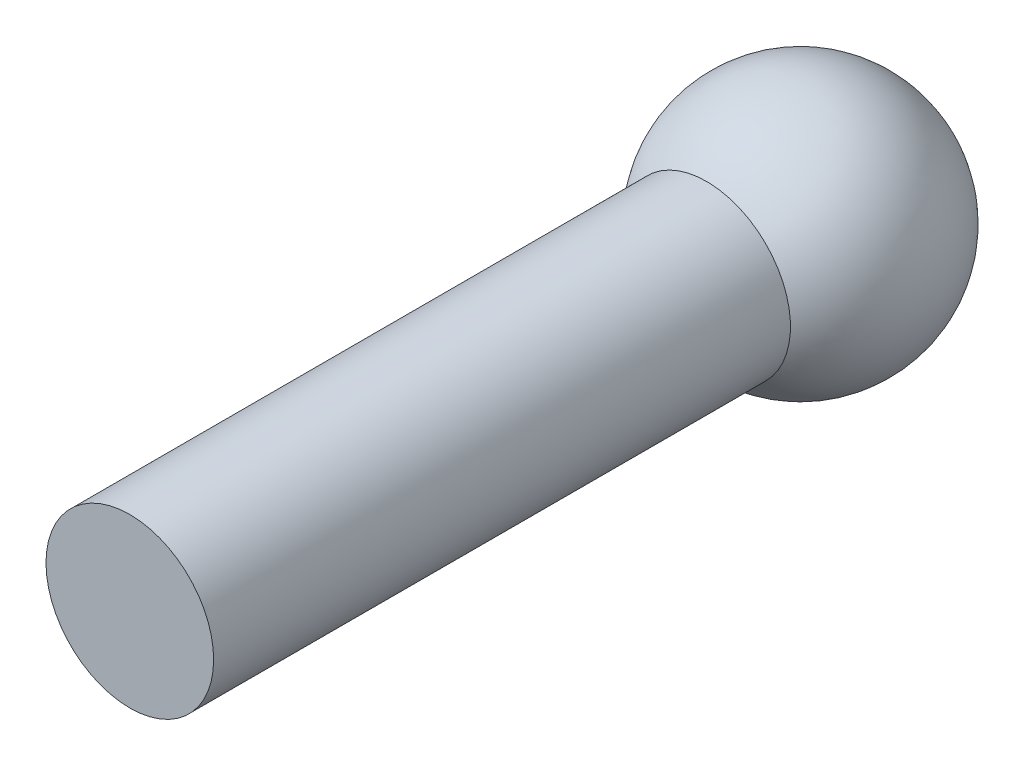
ISO-10303-21;
HEADER;
FILE_DESCRIPTION(('STEP AP214'),'2;1');
FILE_NAME('part.step','',(''),(''),'','','');
FILE_SCHEMA(('AUTOMOTIVE_DESIGN { 1 0 10303 214 1 1 1 1 }'));
ENDSEC;
DATA;
#1=APPLICATION_CONTEXT('core data for automotive mechanical design processes');
#2=APPLICATION_PROTOCOL_DEFINITION('international standard','automotive_design',2000,#1);
#3=PRODUCT_CONTEXT('',#1,'mechanical');
#4=PRODUCT('Part','Part','',(#3));
#5=PRODUCT_RELATED_PRODUCT_CATEGORY('part','',(#4));
#6=PRODUCT_DEFINITION_FORMATION('','',#4);
#7=PRODUCT_DEFINITION_CONTEXT('part definition',#1,'design');
#8=PRODUCT_DEFINITION('design','',#6,#7);
#9=PRODUCT_DEFINITION_SHAPE('','',#8);
#10=(LENGTH_UNIT() NAMED_UNIT(*) SI_UNIT(.MILLI.,.METRE.));
#11=(NAMED_UNIT(*) PLANE_ANGLE_UNIT() SI_UNIT($,.RADIAN.));
#12=(NAMED_UNIT(*) SI_UNIT($,.STERADIAN.) SOLID_ANGLE_UNIT());
#13=UNCERTAINTY_MEASURE_WITH_UNIT(LENGTH_MEASURE(1.E-05),#10,'distance_accuracy_value','');
#14=(GEOMETRIC_REPRESENTATION_CONTEXT(3) GLOBAL_UNCERTAINTY_ASSIGNED_CONTEXT((#13)) GLOBAL_UNIT_ASSIGNED_CONTEXT((#10,
#11,#12)) REPRESENTATION_CONTEXT('',''));
#15=CARTESIAN_POINT('',(0.,0.,0.));
#16=DIRECTION('',(0.,0.,1.));
#17=DIRECTION('',(1.,0.,0.));
#18=AXIS2_PLACEMENT_3D('',#15,#16,#17);
#19=CARTESIAN_POINT('',(0.,0.,4.));
#20=DIRECTION('',(0.,0.,-1.));
#21=DIRECTION('',(-1.,0.,0.));
#22=AXIS2_PLACEMENT_3D('',#19,#20,#21);
#23=CYLINDRICAL_SURFACE('',#22,0.5);
#24=CARTESIAN_POINT('',(0.,0.,4.));
#25=DIRECTION('',(0.,0.,1.));
#26=DIRECTION('',(1.,0.,0.));
#27=AXIS2_PLACEMENT_3D('',#24,#25,#26);
#28=CIRCLE('',#27,0.5);
#29=CARTESIAN_POINT('',(0.5,0.,4.));
#30=VERTEX_POINT('',#29);
#31=EDGE_CURVE('E39',#30,#30,#28,.T.);
#32=ORIENTED_EDGE('',*,*,#31,.F.);
#33=EDGE_LOOP('',(#32));
#34=FACE_BOUND('',#33,.T.);
#35=CARTESIAN_POINT('',(0.,0.,0.559016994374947));
#36=DIRECTION('',(0.,0.,-1.));
#37=DIRECTION('',(-1.,0.,0.));
#38=AXIS2_PLACEMENT_3D('',#35,#36,#37);
#39=CIRCLE('',#38,0.5);
#40=CARTESIAN_POINT('',(-0.5,0.,0.559016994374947));
#41=VERTEX_POINT('',#40);
#42=EDGE_CURVE('E10',#41,#41,#39,.T.);
#43=ORIENTED_EDGE('',*,*,#42,.F.);
#44=EDGE_LOOP('',(#43));
#45=FACE_BOUND('',#44,.T.);
#46=ADVANCED_FACE('F33',(#34,#45),#23,.T.);
#47=CARTESIAN_POINT('',(0.,0.,4.));
#48=DIRECTION('',(0.,0.,1.));
#49=DIRECTION('',(1.,0.,0.));
#50=AXIS2_PLACEMENT_3D('',#47,#48,#49);
#51=PLANE('',#50);
#52=ORIENTED_EDGE('',*,*,#31,.T.);
#53=EDGE_LOOP('',(#52));
#54=FACE_BOUND('',#53,.T.);
#55=ADVANCED_FACE('F45',(#54),#51,.T.);
#56=CARTESIAN_POINT('',(0.,0.,0.));
#57=DIRECTION('',(0.,1.,0.));
#58=DIRECTION('',(1.,0.,0.));
#59=AXIS2_PLACEMENT_3D('',#56,#57,#58);
#60=SPHERICAL_SURFACE('',#59,0.75);
#61=CARTESIAN_POINT('',(0.,0.,0.));
#62=DIRECTION('',(0.,0.,-1.));
#63=DIRECTION('',(-1.,0.,0.));
#64=AXIS2_PLACEMENT_3D('',#61,#62,#63);
#65=SPHERICAL_SURFACE('',#64,0.75);
#66=ORIENTED_EDGE('',*,*,#42,.T.);
#67=EDGE_LOOP('',(#66));
#68=FACE_BOUND('',#67,.T.);
#69=ADVANCED_FACE('F52',(#68),#65,.T.);
#70=CLOSED_SHELL('',(#46,#55,#69));
#71=MANIFOLD_SOLID_BREP('B2',#70);
#72=ADVANCED_BREP_SHAPE_REPRESENTATION('',(#18,#71),#14);
#73=SHAPE_DEFINITION_REPRESENTATION(#9,#72);
ENDSEC;
END-ISO-10303-21;
